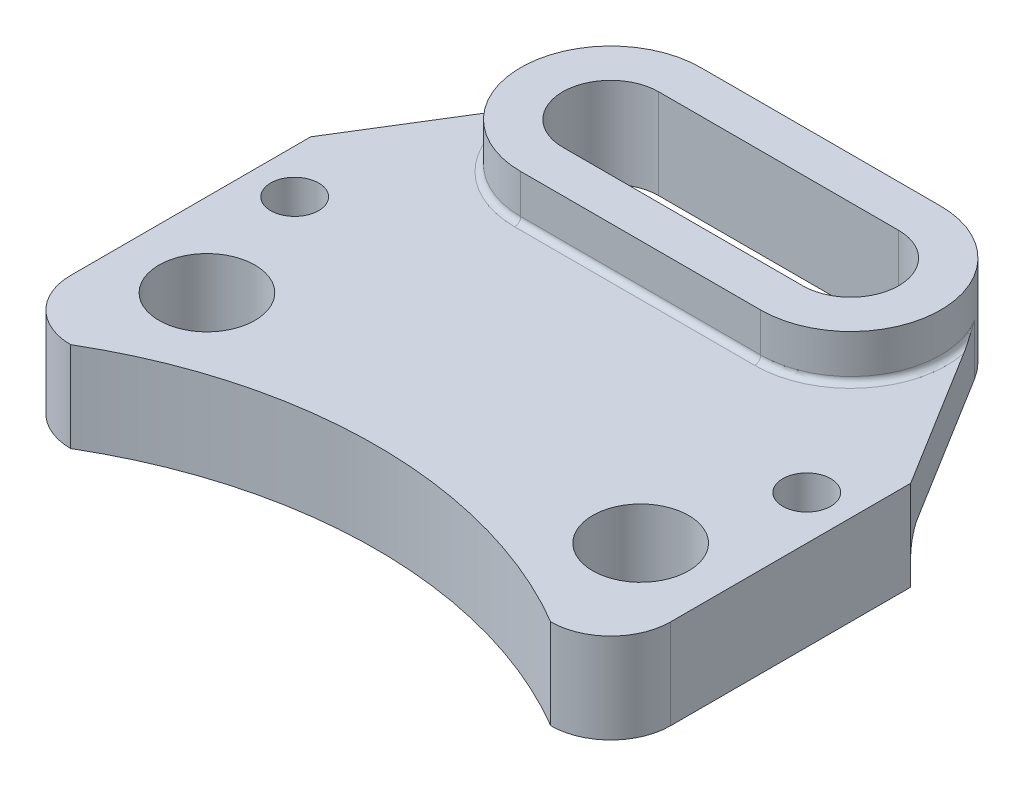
ISO-10303-21;
HEADER;
FILE_DESCRIPTION(('STEP AP214'),'2;1');
FILE_NAME('part.step','',(''),(''),'','','');
FILE_SCHEMA(('AUTOMOTIVE_DESIGN { 1 0 10303 214 1 1 1 1 }'));
ENDSEC;
DATA;
#1=APPLICATION_CONTEXT('core data for automotive mechanical design processes');
#2=APPLICATION_PROTOCOL_DEFINITION('international standard','automotive_design',2000,#1);
#3=PRODUCT_CONTEXT('',#1,'mechanical');
#4=PRODUCT('Part','Part','',(#3));
#5=PRODUCT_RELATED_PRODUCT_CATEGORY('part','',(#4));
#6=PRODUCT_DEFINITION_FORMATION('','',#4);
#7=PRODUCT_DEFINITION_CONTEXT('part definition',#1,'design');
#8=PRODUCT_DEFINITION('design','',#6,#7);
#9=PRODUCT_DEFINITION_SHAPE('','',#8);
#10=(LENGTH_UNIT() NAMED_UNIT(*) SI_UNIT(.MILLI.,.METRE.));
#11=(NAMED_UNIT(*) PLANE_ANGLE_UNIT() SI_UNIT($,.RADIAN.));
#12=(NAMED_UNIT(*) SI_UNIT($,.STERADIAN.) SOLID_ANGLE_UNIT());
#13=UNCERTAINTY_MEASURE_WITH_UNIT(LENGTH_MEASURE(1.E-05),#10,'distance_accuracy_value','');
#14=(GEOMETRIC_REPRESENTATION_CONTEXT(3) GLOBAL_UNCERTAINTY_ASSIGNED_CONTEXT((#13)) GLOBAL_UNIT_ASSIGNED_CONTEXT((#10,
#11,#12)) REPRESENTATION_CONTEXT('',''));
#15=CARTESIAN_POINT('',(0.,0.,0.));
#16=DIRECTION('',(0.,0.,1.));
#17=DIRECTION('',(1.,0.,0.));
#18=AXIS2_PLACEMENT_3D('',#15,#16,#17);
#19=CARTESIAN_POINT('',(0.,16.,-13.9997133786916));
#20=DIRECTION('',(1.,0.,0.));
#21=DIRECTION('',(0.,0.,-1.));
#22=AXIS2_PLACEMENT_3D('',#19,#20,#21);
#23=CYLINDRICAL_SURFACE('',#22,1.);
#24=CARTESIAN_POINT('',(69.9995364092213,16.,-13.9997133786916));
#25=DIRECTION('',(-1.,0.,0.));
#26=DIRECTION('',(0.,0.,1.));
#27=AXIS2_PLACEMENT_3D('',#24,#25,#26);
#28=CIRCLE('',#27,1.);
#29=CARTESIAN_POINT('',(69.9995364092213,16.,-14.9997133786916));
#30=VERTEX_POINT('',#29);
#31=CARTESIAN_POINT('',(69.9995364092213,15.,-13.9997133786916));
#32=VERTEX_POINT('',#31);
#33=EDGE_CURVE('E57',#30,#32,#28,.T.);
#34=ORIENTED_EDGE('',*,*,#33,.F.);
#35=DIRECTION('',(1.,0.,0.));
#36=VECTOR('',#35,1.);
#37=CARTESIAN_POINT('',(0.,16.,-14.9997133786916));
#38=LINE('',#37,#36);
#39=CARTESIAN_POINT('',(29.9995364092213,16.,-14.9997133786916));
#40=VERTEX_POINT('',#39);
#41=EDGE_CURVE('E360',#40,#30,#38,.T.);
#42=ORIENTED_EDGE('',*,*,#41,.F.);
#43=CARTESIAN_POINT('',(29.9995364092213,16.,-13.9997133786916));
#44=DIRECTION('',(-1.,0.,0.));
#45=DIRECTION('',(0.,0.,1.));
#46=AXIS2_PLACEMENT_3D('',#43,#44,#45);
#47=CIRCLE('',#46,1.);
#48=CARTESIAN_POINT('',(29.9995364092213,15.,-13.9997133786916));
#49=VERTEX_POINT('',#48);
#50=EDGE_CURVE('E374',#40,#49,#47,.T.);
#51=ORIENTED_EDGE('',*,*,#50,.T.);
#52=DIRECTION('',(1.,0.,0.));
#53=VECTOR('',#52,1.);
#54=CARTESIAN_POINT('',(90.,15.,-13.9997133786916));
#55=LINE('',#54,#53);
#56=EDGE_CURVE('E354',#32,#49,#55,.F.);
#57=ORIENTED_EDGE('',*,*,#56,.F.);
#58=EDGE_LOOP('',(#34,#42,#51,#57));
#59=FACE_BOUND('',#58,.T.);
#60=ADVANCED_FACE('F45',(#59),#23,.F.);
#61=CARTESIAN_POINT('',(29.9995364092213,16.,-29.9997133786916));
#62=DIRECTION('',(0.,1.,0.));
#63=DIRECTION('',(0.,0.,1.));
#64=AXIS2_PLACEMENT_3D('',#61,#62,#63);
#65=TOROIDAL_SURFACE('',#64,16.,1.);
#66=ORIENTED_EDGE('',*,*,#50,.F.);
#67=CARTESIAN_POINT('',(29.9995364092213,16.,-29.9997133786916));
#68=DIRECTION('',(0.,1.,0.));
#69=DIRECTION('',(0.,0.,1.));
#70=AXIS2_PLACEMENT_3D('',#67,#68,#69);
#71=CIRCLE('',#70,15.);
#72=CARTESIAN_POINT('',(17.2408948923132,16.,-37.8874929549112));
#73=VERTEX_POINT('',#72);
#74=EDGE_CURVE('E348',#73,#40,#71,.T.);
#75=ORIENTED_EDGE('',*,*,#74,.F.);
#76=CARTESIAN_POINT('',(14.3130750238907,15.,-33.1516856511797));
#77=CARTESIAN_POINT('',(14.3572474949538,15.0000065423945,-33.2231355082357));
#78=CARTESIAN_POINT('',(14.4014147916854,15.0012809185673,-33.2945769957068));
#79=CARTESIAN_POINT('',(14.4897080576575,15.0061151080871,-33.437393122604));
#80=CARTESIAN_POINT('',(14.5338340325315,15.0096745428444,-33.5087677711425));
#81=CARTESIAN_POINT('',(14.6660517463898,15.0233982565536,-33.7226325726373));
#82=CARTESIAN_POINT('',(14.754057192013,15.0366087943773,-33.8649831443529));
#83=CARTESIAN_POINT('',(14.9293958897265,15.0695611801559,-34.1485970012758));
#84=CARTESIAN_POINT('',(15.0167304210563,15.089279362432,-34.2898623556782));
#85=CARTESIAN_POINT('',(15.1910337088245,15.1340925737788,-34.5718014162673));
#86=CARTESIAN_POINT('',(15.2780023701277,15.1591889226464,-34.7124749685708));
#87=CARTESIAN_POINT('',(15.5218635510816,15.2358867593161,-35.1069253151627));
#88=CARTESIAN_POINT('',(15.6783187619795,15.2924886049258,-35.3599947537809));
#89=CARTESIAN_POINT('',(15.990140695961,15.4155229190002,-35.8643729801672));
#90=CARTESIAN_POINT('',(16.1455073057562,15.4819563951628,-36.1156815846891));
#91=CARTESIAN_POINT('',(16.6108551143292,15.6906909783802,-36.8683909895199));
#92=CARTESIAN_POINT('',(16.9196629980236,15.842272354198,-37.3678939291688));
#93=CARTESIAN_POINT('',(17.2325804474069,15.9959175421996,-37.8740441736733));
#94=CARTESIAN_POINT('',(17.2367376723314,15.997958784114,-37.8807685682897));
#95=CARTESIAN_POINT('',(17.2408948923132,16.,-37.8874929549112));
#96=B_SPLINE_CURVE_WITH_KNOTS('',3,(#76,#77,#78,#79,#80,#81,#82,#83,#84,#85,#86,#87,#88,#89,#90,
#91,#92,#93,#94,#95),.UNSPECIFIED.,.F.,.F.,(4,2,2,2,2,2,2,2,2,4),(0.,0.251980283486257,
0.503918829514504,1.00737471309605,1.50901954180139,2.01078761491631,2.91909735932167,
3.82750026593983,5.64675090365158,5.67124580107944),.UNSPECIFIED.);
#97=CARTESIAN_POINT('',(14.3130750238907,15.,-33.1516856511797));
#98=VERTEX_POINT('',#97);
#99=EDGE_CURVE('E366',#73,#98,#96,.F.);
#100=ORIENTED_EDGE('',*,*,#99,.T.);
#101=CARTESIAN_POINT('',(29.9995364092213,15.,-29.9997133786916));
#102=DIRECTION('',(0.,1.,0.));
#103=DIRECTION('',(0.,0.,1.));
#104=AXIS2_PLACEMENT_3D('',#101,#102,#103);
#105=CIRCLE('',#104,16.);
#106=EDGE_CURVE('E357',#49,#98,#105,.F.);
#107=ORIENTED_EDGE('',*,*,#106,.F.);
#108=EDGE_LOOP('',(#66,#75,#100,#107));
#109=FACE_BOUND('',#108,.T.);
#110=ADVANCED_FACE('F378',(#109),#65,.F.);
#111=CARTESIAN_POINT('',(69.9995364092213,16.,-29.9997133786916));
#112=DIRECTION('',(0.,1.,0.));
#113=DIRECTION('',(0.,0.,1.));
#114=AXIS2_PLACEMENT_3D('',#111,#112,#113);
#115=TOROIDAL_SURFACE('',#114,16.,1.);
#116=CARTESIAN_POINT('',(69.9995364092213,16.,-29.9997133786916));
#117=DIRECTION('',(0.,1.,0.));
#118=DIRECTION('',(0.,0.,1.));
#119=AXIS2_PLACEMENT_3D('',#116,#117,#118);
#120=CIRCLE('',#119,15.);
#121=CARTESIAN_POINT('',(82.7579881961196,16.,-37.8877998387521));
#122=VERTEX_POINT('',#121);
#123=EDGE_CURVE('E363',#30,#122,#120,.T.);
#124=ORIENTED_EDGE('',*,*,#123,.F.);
#125=ORIENTED_EDGE('',*,*,#33,.T.);
#126=CARTESIAN_POINT('',(69.9995364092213,15.,-29.9997133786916));
#127=DIRECTION('',(0.,1.,0.));
#128=DIRECTION('',(0.,0.,1.));
#129=AXIS2_PLACEMENT_3D('',#126,#127,#128);
#130=CIRCLE('',#129,16.);
#131=CARTESIAN_POINT('',(85.6859219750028,15.,-33.1520629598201));
#132=VERTEX_POINT('',#131);
#133=EDGE_CURVE('E351',#132,#32,#130,.F.);
#134=ORIENTED_EDGE('',*,*,#133,.F.);
#135=CARTESIAN_POINT('',(85.6859219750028,15.,-33.1520629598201));
#136=CARTESIAN_POINT('',(85.6417477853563,15.0000065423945,-33.223511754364));
#137=CARTESIAN_POINT('',(85.5975787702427,15.0012809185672,-33.2949521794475));
#138=CARTESIAN_POINT('',(85.5092820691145,15.0061151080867,-33.4377661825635));
#139=CARTESIAN_POINT('',(85.4651543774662,15.0096745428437,-33.5091397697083));
#140=CARTESIAN_POINT('',(85.3329315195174,15.0233982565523,-33.7230013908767));
#141=CARTESIAN_POINT('',(85.2449226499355,15.0366087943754,-33.8653498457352));
#142=CARTESIAN_POINT('',(85.069577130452,15.0695611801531,-34.1489594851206));
#143=CARTESIAN_POINT('',(84.9822392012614,15.0892793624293,-34.2902227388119));
#144=CARTESIAN_POINT('',(84.8079291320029,15.1340925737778,-34.5721576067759));
#145=CARTESIAN_POINT('',(84.7209570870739,15.1591889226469,-34.7128290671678));
#146=CARTESIAN_POINT('',(84.4770864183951,15.235886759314,-35.1072735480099));
#147=CARTESIAN_POINT('',(84.3206251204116,15.2924886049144,-35.3603392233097));
#148=CARTESIAN_POINT('',(84.0087910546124,15.415522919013,-35.8647099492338));
#149=CARTESIAN_POINT('',(83.8534184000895,15.481956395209,-36.1160148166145));
#150=CARTESIAN_POINT('',(83.388052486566,15.6906909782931,-36.8687130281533));
#151=CARTESIAN_POINT('',(83.079232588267,15.8422723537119,-37.3682085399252));
#152=CARTESIAN_POINT('',(82.7663029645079,15.9959175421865,-37.87435125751));
#153=CARTESIAN_POINT('',(82.7621455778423,15.9979587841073,-37.8810755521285));
#154=CARTESIAN_POINT('',(82.7579881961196,16.,-37.8877998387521));
#155=B_SPLINE_CURVE_WITH_KNOTS('',3,(#135,#136,#137,#138,#139,#140,#141,#142,#143,#144,#145,
#146,#147,#148,#149,#150,#151,#152,#153,#154),.UNSPECIFIED.,.F.,.F.,(4,2,2,2,2,2,2,2,2,4),(0.,
0.251980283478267,0.503918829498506,1.00737471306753,1.50901954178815,2.01078761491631,
2.91909735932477,3.82750026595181,5.64675090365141,5.67124580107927),.UNSPECIFIED.);
#156=EDGE_CURVE('E11',#132,#122,#155,.T.);
#157=ORIENTED_EDGE('',*,*,#156,.T.);
#158=EDGE_LOOP('',(#124,#125,#134,#157));
#159=FACE_BOUND('',#158,.T.);
#160=ADVANCED_FACE('F382',(#159),#115,.F.);
#161=CARTESIAN_POINT('',(0.,4.5,-13.));
#162=DIRECTION('',(1.,0.,0.));
#163=DIRECTION('',(0.,0.,-1.));
#164=AXIS2_PLACEMENT_3D('',#161,#162,#163);
#165=CYLINDRICAL_SURFACE('',#164,3.);
#166=DIRECTION('',(-1.,0.,0.));
#167=VECTOR('',#166,1.);
#168=CARTESIAN_POINT('',(0.,7.5,-13.));
#169=LINE('',#168,#167);
#170=CARTESIAN_POINT('',(98.1452091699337,7.5,-13.));
#171=VERTEX_POINT('',#170);
#172=CARTESIAN_POINT('',(1.85469108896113,7.5,-13.));
#173=VERTEX_POINT('',#172);
#174=EDGE_CURVE('E337',#171,#173,#169,.T.);
#175=ORIENTED_EDGE('',*,*,#174,.F.);
#176=CARTESIAN_POINT('',(98.1452091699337,4.5,-13.));
#177=DIRECTION('',(0.850563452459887,0.,-0.525872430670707));
#178=DIRECTION('',(0.525872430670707,0.,0.850563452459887));
#179=AXIS2_PLACEMENT_3D('',#176,#177,#178);
#180=ELLIPSE('',#179,3.52707371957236,3.);
#181=CARTESIAN_POINT('',(100.,4.5,-10.));
#182=VERTEX_POINT('',#181);
#183=EDGE_CURVE('E343',#171,#182,#180,.T.);
#184=ORIENTED_EDGE('',*,*,#183,.T.);
#185=DIRECTION('',(-1.,0.,0.));
#186=VECTOR('',#185,1.);
#187=CARTESIAN_POINT('',(0.,4.5,-10.));
#188=LINE('',#187,#186);
#189=CARTESIAN_POINT('',(0.,4.5,-10.));
#190=VERTEX_POINT('',#189);
#191=EDGE_CURVE('E340',#190,#182,#188,.F.);
#192=ORIENTED_EDGE('',*,*,#191,.F.);
#193=CARTESIAN_POINT('',(1.85469108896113,4.5,-13.));
#194=DIRECTION('',(0.850576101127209,0.,0.525851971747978));
#195=DIRECTION('',(0.525851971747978,0.,-0.850576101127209));
#196=AXIS2_PLACEMENT_3D('',#193,#194,#195);
#197=ELLIPSE('',#196,3.52702126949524,3.);
#198=EDGE_CURVE('E346',#190,#173,#197,.F.);
#199=ORIENTED_EDGE('',*,*,#198,.T.);
#200=EDGE_LOOP('',(#175,#184,#192,#199));
#201=FACE_BOUND('',#200,.T.);
#202=ADVANCED_FACE('F384',(#201),#165,.F.);
#203=CARTESIAN_POINT('',(0.,15.,-10.));
#204=DIRECTION('',(0.,0.,1.));
#205=DIRECTION('',(1.,0.,0.));
#206=AXIS2_PLACEMENT_3D('',#203,#204,#205);
#207=PLANE('',#206);
#208=DIRECTION('',(0.,-1.,0.));
#209=VECTOR('',#208,1.);
#210=CARTESIAN_POINT('',(0.,15.,-10.));
#211=LINE('',#210,#209);
#212=CARTESIAN_POINT('',(0.,0.,-10.));
#213=VERTEX_POINT('',#212);
#214=EDGE_CURVE('E306',#190,#213,#211,.T.);
#215=ORIENTED_EDGE('',*,*,#214,.F.);
#216=ORIENTED_EDGE('',*,*,#191,.T.);
#217=DIRECTION('',(0.,-1.,0.));
#218=VECTOR('',#217,1.);
#219=CARTESIAN_POINT('',(100.,15.,-10.));
#220=LINE('',#219,#218);
#221=CARTESIAN_POINT('',(100.,0.,-10.));
#222=VERTEX_POINT('',#221);
#223=EDGE_CURVE('E322',#182,#222,#220,.T.);
#224=ORIENTED_EDGE('',*,*,#223,.T.);
#225=DIRECTION('',(-1.,0.,0.));
#226=VECTOR('',#225,1.);
#227=CARTESIAN_POINT('',(0.,0.,-10.));
#228=LINE('',#227,#226);
#229=EDGE_CURVE('E298',#222,#213,#228,.T.);
#230=ORIENTED_EDGE('',*,*,#229,.T.);
#231=EDGE_LOOP('',(#215,#216,#224,#230));
#232=FACE_BOUND('',#231,.T.);
#233=ADVANCED_FACE('F393',(#232),#207,.F.);
#234=CARTESIAN_POINT('',(0.,15.,0.));
#235=DIRECTION('',(1.,0.,0.));
#236=DIRECTION('',(0.,0.,-1.));
#237=AXIS2_PLACEMENT_3D('',#234,#235,#236);
#238=PLANE('',#237);
#239=DIRECTION('',(0.,0.,1.));
#240=VECTOR('',#239,1.);
#241=CARTESIAN_POINT('',(0.,0.,0.));
#242=LINE('',#241,#240);
#243=CARTESIAN_POINT('',(0.,0.,29.9999999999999));
#244=VERTEX_POINT('',#243);
#245=EDGE_CURVE('E292',#213,#244,#242,.T.);
#246=ORIENTED_EDGE('',*,*,#245,.T.);
#247=DIRECTION('',(0.,-1.,0.));
#248=VECTOR('',#247,1.);
#249=CARTESIAN_POINT('',(0.,15.,29.9999999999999));
#250=LINE('',#249,#248);
#251=CARTESIAN_POINT('',(0.,15.,29.9999999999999));
#252=VERTEX_POINT('',#251);
#253=EDGE_CURVE('E334',#252,#244,#250,.T.);
#254=ORIENTED_EDGE('',*,*,#253,.F.);
#255=DIRECTION('',(0.,0.,1.));
#256=VECTOR('',#255,1.);
#257=CARTESIAN_POINT('',(0.,15.,0.));
#258=LINE('',#257,#256);
#259=CARTESIAN_POINT('',(0.,15.,-10.));
#260=VERTEX_POINT('',#259);
#261=EDGE_CURVE('E295',#260,#252,#258,.T.);
#262=ORIENTED_EDGE('',*,*,#261,.F.);
#263=EDGE_CURVE('E320',#260,#190,#211,.T.);
#264=ORIENTED_EDGE('',*,*,#263,.T.);
#265=ORIENTED_EDGE('',*,*,#214,.T.);
#266=EDGE_LOOP('',(#246,#254,#262,#264,#265));
#267=FACE_BOUND('',#266,.T.);
#268=ADVANCED_FACE('F526',(#267),#238,.F.);
#269=CARTESIAN_POINT('',(10.,15.,30.));
#270=DIRECTION('',(0.,-1.,0.));
#271=DIRECTION('',(0.,0.,-1.));
#272=AXIS2_PLACEMENT_3D('',#269,#270,#271);
#273=CYLINDRICAL_SURFACE('',#272,10.);
#274=CARTESIAN_POINT('',(10.,0.,30.));
#275=DIRECTION('',(0.,1.,0.));
#276=DIRECTION('',(0.,0.,1.));
#277=AXIS2_PLACEMENT_3D('',#274,#275,#276);
#278=CIRCLE('',#277,10.);
#279=CARTESIAN_POINT('',(10.,0.,40.));
#280=VERTEX_POINT('',#279);
#281=EDGE_CURVE('E308',#244,#280,#278,.T.);
#282=ORIENTED_EDGE('',*,*,#281,.T.);
#283=DIRECTION('',(0.,-1.,0.));
#284=VECTOR('',#283,1.);
#285=CARTESIAN_POINT('',(10.,15.,40.));
#286=LINE('',#285,#284);
#287=CARTESIAN_POINT('',(10.,15.,40.));
#288=VERTEX_POINT('',#287);
#289=EDGE_CURVE('E331',#288,#280,#286,.T.);
#290=ORIENTED_EDGE('',*,*,#289,.F.);
#291=CARTESIAN_POINT('',(10.,15.,30.));
#292=DIRECTION('',(0.,1.,0.));
#293=DIRECTION('',(0.,0.,1.));
#294=AXIS2_PLACEMENT_3D('',#291,#292,#293);
#295=CIRCLE('',#294,10.);
#296=EDGE_CURVE('E297',#252,#288,#295,.T.);
#297=ORIENTED_EDGE('',*,*,#296,.F.);
#298=ORIENTED_EDGE('',*,*,#253,.T.);
#299=EDGE_LOOP('',(#282,#290,#297,#298));
#300=FACE_BOUND('',#299,.T.);
#301=ADVANCED_FACE('F607',(#300),#273,.T.);
#302=CARTESIAN_POINT('',(50.,15.,107.754881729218));
#303=DIRECTION('',(0.,-1.,0.));
#304=DIRECTION('',(0.,0.,-1.));
#305=AXIS2_PLACEMENT_3D('',#302,#303,#304);
#306=CYLINDRICAL_SURFACE('',#305,78.6811540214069);
#307=CARTESIAN_POINT('',(50.,0.,107.754881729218));
#308=DIRECTION('',(0.,-1.,0.));
#309=DIRECTION('',(0.,0.,-1.));
#310=AXIS2_PLACEMENT_3D('',#307,#308,#309);
#311=CIRCLE('',#310,78.6811540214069);
#312=CARTESIAN_POINT('',(90.,0.,40.));
#313=VERTEX_POINT('',#312);
#314=EDGE_CURVE('E310',#280,#313,#311,.T.);
#315=ORIENTED_EDGE('',*,*,#314,.T.);
#316=DIRECTION('',(0.,-1.,0.));
#317=VECTOR('',#316,1.);
#318=CARTESIAN_POINT('',(90.,15.,40.));
#319=LINE('',#318,#317);
#320=CARTESIAN_POINT('',(90.,15.,40.));
#321=VERTEX_POINT('',#320);
#322=EDGE_CURVE('E328',#321,#313,#319,.T.);
#323=ORIENTED_EDGE('',*,*,#322,.F.);
#324=CARTESIAN_POINT('',(50.,15.,107.754881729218));
#325=DIRECTION('',(0.,-1.,0.));
#326=DIRECTION('',(0.,0.,-1.));
#327=AXIS2_PLACEMENT_3D('',#324,#325,#326);
#328=CIRCLE('',#327,78.6811540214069);
#329=EDGE_CURVE('E300',#288,#321,#328,.T.);
#330=ORIENTED_EDGE('',*,*,#329,.F.);
#331=ORIENTED_EDGE('',*,*,#289,.T.);
#332=EDGE_LOOP('',(#315,#323,#330,#331));
#333=FACE_BOUND('',#332,.T.);
#334=ADVANCED_FACE('F598',(#333),#306,.F.);
#335=CARTESIAN_POINT('',(90.,15.,30.));
#336=DIRECTION('',(0.,-1.,0.));
#337=DIRECTION('',(0.,0.,-1.));
#338=AXIS2_PLACEMENT_3D('',#335,#336,#337);
#339=CYLINDRICAL_SURFACE('',#338,10.);
#340=CARTESIAN_POINT('',(90.,0.,30.));
#341=DIRECTION('',(0.,1.,0.));
#342=DIRECTION('',(0.,0.,1.));
#343=AXIS2_PLACEMENT_3D('',#340,#341,#342);
#344=CIRCLE('',#343,10.);
#345=CARTESIAN_POINT('',(100.,0.,29.9999999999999));
#346=VERTEX_POINT('',#345);
#347=EDGE_CURVE('E312',#313,#346,#344,.T.);
#348=ORIENTED_EDGE('',*,*,#347,.T.);
#349=DIRECTION('',(0.,-1.,0.));
#350=VECTOR('',#349,1.);
#351=CARTESIAN_POINT('',(100.,15.,29.9999999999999));
#352=LINE('',#351,#350);
#353=CARTESIAN_POINT('',(100.,15.,29.9999999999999));
#354=VERTEX_POINT('',#353);
#355=EDGE_CURVE('E325',#354,#346,#352,.T.);
#356=ORIENTED_EDGE('',*,*,#355,.F.);
#357=CARTESIAN_POINT('',(90.,15.,30.));
#358=DIRECTION('',(0.,1.,0.));
#359=DIRECTION('',(0.,0.,1.));
#360=AXIS2_PLACEMENT_3D('',#357,#358,#359);
#361=CIRCLE('',#360,10.);
#362=EDGE_CURVE('E302',#321,#354,#361,.T.);
#363=ORIENTED_EDGE('',*,*,#362,.F.);
#364=ORIENTED_EDGE('',*,*,#322,.T.);
#365=EDGE_LOOP('',(#348,#356,#363,#364));
#366=FACE_BOUND('',#365,.T.);
#367=ADVANCED_FACE('F589',(#366),#339,.T.);
#368=CARTESIAN_POINT('',(100.,15.,-10.));
#369=DIRECTION('',(-1.,0.,0.));
#370=DIRECTION('',(0.,0.,1.));
#371=AXIS2_PLACEMENT_3D('',#368,#369,#370);
#372=PLANE('',#371);
#373=DIRECTION('',(0.,0.,-1.));
#374=VECTOR('',#373,1.);
#375=CARTESIAN_POINT('',(100.,0.,-10.));
#376=LINE('',#375,#374);
#377=EDGE_CURVE('E315',#346,#222,#376,.T.);
#378=ORIENTED_EDGE('',*,*,#377,.T.);
#379=ORIENTED_EDGE('',*,*,#223,.F.);
#380=CARTESIAN_POINT('',(100.,15.,-10.));
#381=VERTEX_POINT('',#380);
#382=EDGE_CURVE('E323',#381,#182,#220,.T.);
#383=ORIENTED_EDGE('',*,*,#382,.F.);
#384=DIRECTION('',(0.,0.,-1.));
#385=VECTOR('',#384,1.);
#386=CARTESIAN_POINT('',(100.,15.,29.9999999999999));
#387=LINE('',#386,#385);
#388=EDGE_CURVE('E304',#354,#381,#387,.T.);
#389=ORIENTED_EDGE('',*,*,#388,.F.);
#390=ORIENTED_EDGE('',*,*,#355,.T.);
#391=EDGE_LOOP('',(#378,#379,#383,#389,#390));
#392=FACE_BOUND('',#391,.T.);
#393=ADVANCED_FACE('F580',(#392),#372,.F.);
#394=CARTESIAN_POINT('',(90.,15.,30.));
#395=DIRECTION('',(0.,1.,0.));
#396=DIRECTION('',(0.,0.,1.));
#397=AXIS2_PLACEMENT_3D('',#394,#395,#396);
#398=PLANE('',#397);
#399=CARTESIAN_POINT('',(86.1412236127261,15.,21.1505395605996));
#400=DIRECTION('',(0.,-1.,0.));
#401=DIRECTION('',(0.,0.,1.));
#402=AXIS2_PLACEMENT_3D('',#399,#400,#401);
#403=CIRCLE('',#402,8.);
#404=CARTESIAN_POINT('',(86.1412236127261,15.,29.1505395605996));
#405=VERTEX_POINT('',#404);
#406=EDGE_CURVE('E269',#405,#405,#403,.T.);
#407=ORIENTED_EDGE('',*,*,#406,.T.);
#408=EDGE_LOOP('',(#407));
#409=FACE_BOUND('',#408,.T.);
#410=CARTESIAN_POINT('',(92.672770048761,15.,0.));
#411=DIRECTION('',(0.,-1.,0.));
#412=DIRECTION('',(0.,0.,1.));
#413=AXIS2_PLACEMENT_3D('',#410,#411,#412);
#414=CIRCLE('',#413,3.99999999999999);
#415=CARTESIAN_POINT('',(92.672770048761,15.,4.00000000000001));
#416=VERTEX_POINT('',#415);
#417=EDGE_CURVE('E281',#416,#416,#414,.T.);
#418=ORIENTED_EDGE('',*,*,#417,.T.);
#419=EDGE_LOOP('',(#418));
#420=FACE_BOUND('',#419,.T.);
#421=CARTESIAN_POINT('',(7.32722995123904,15.,0.));
#422=DIRECTION('',(0.,-1.,0.));
#423=DIRECTION('',(0.,0.,-1.));
#424=AXIS2_PLACEMENT_3D('',#421,#422,#423);
#425=CIRCLE('',#424,4.);
#426=CARTESIAN_POINT('',(7.32722995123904,15.,-4.));
#427=VERTEX_POINT('',#426);
#428=EDGE_CURVE('E275',#427,#427,#425,.T.);
#429=ORIENTED_EDGE('',*,*,#428,.T.);
#430=EDGE_LOOP('',(#429));
#431=FACE_BOUND('',#430,.T.);
#432=CARTESIAN_POINT('',(13.8587763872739,15.,21.1505395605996));
#433=DIRECTION('',(0.,-1.,0.));
#434=DIRECTION('',(0.,0.,-1.));
#435=AXIS2_PLACEMENT_3D('',#432,#433,#434);
#436=CIRCLE('',#435,8.);
#437=CARTESIAN_POINT('',(13.8587763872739,15.,13.1505395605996));
#438=VERTEX_POINT('',#437);
#439=EDGE_CURVE('E289',#438,#438,#436,.T.);
#440=ORIENTED_EDGE('',*,*,#439,.T.);
#441=EDGE_LOOP('',(#440));
#442=FACE_BOUND('',#441,.T.);
#443=ORIENTED_EDGE('',*,*,#56,.T.);
#444=ORIENTED_EDGE('',*,*,#106,.T.);
#445=DIRECTION('',(0.525851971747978,0.,-0.850576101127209));
#446=VECTOR('',#445,1.);
#447=CARTESIAN_POINT('',(-4.4727711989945,15.,-2.76520296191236));
#448=LINE('',#447,#446);
#449=EDGE_CURVE('E257',#260,#98,#448,.T.);
#450=ORIENTED_EDGE('',*,*,#449,.F.);
#451=ORIENTED_EDGE('',*,*,#261,.T.);
#452=ORIENTED_EDGE('',*,*,#296,.T.);
#453=ORIENTED_EDGE('',*,*,#329,.T.);
#454=ORIENTED_EDGE('',*,*,#362,.T.);
#455=ORIENTED_EDGE('',*,*,#388,.T.);
#456=DIRECTION('',(-0.525872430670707,0.,-0.850563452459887));
#457=VECTOR('',#456,1.);
#458=CARTESIAN_POINT('',(76.8186973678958,15.,-47.4942051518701));
#459=LINE('',#458,#457);
#460=EDGE_CURVE('E261',#381,#132,#459,.T.);
#461=ORIENTED_EDGE('',*,*,#460,.T.);
#462=ORIENTED_EDGE('',*,*,#133,.T.);
#463=EDGE_LOOP('',(#443,#444,#450,#451,#452,#453,#454,#455,#461,#462));
#464=FACE_BOUND('',#463,.T.);
#465=ADVANCED_FACE('F572',(#409,#420,#431,#442,#464),#398,.T.);
#466=CARTESIAN_POINT('',(90.,0.,30.));
#467=DIRECTION('',(0.,1.,0.));
#468=DIRECTION('',(0.,0.,1.));
#469=AXIS2_PLACEMENT_3D('',#466,#467,#468);
#470=PLANE('',#469);
#471=CARTESIAN_POINT('',(86.1412236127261,0.,21.1505395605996));
#472=DIRECTION('',(0.,-1.,0.));
#473=DIRECTION('',(0.,0.,1.));
#474=AXIS2_PLACEMENT_3D('',#471,#472,#473);
#475=CIRCLE('',#474,8.);
#476=CARTESIAN_POINT('',(86.1412236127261,0.,29.1505395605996));
#477=VERTEX_POINT('',#476);
#478=EDGE_CURVE('E284',#477,#477,#475,.T.);
#479=ORIENTED_EDGE('',*,*,#478,.F.);
#480=EDGE_LOOP('',(#479));
#481=FACE_BOUND('',#480,.T.);
#482=CARTESIAN_POINT('',(92.672770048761,0.,0.));
#483=DIRECTION('',(0.,-1.,0.));
#484=DIRECTION('',(0.,0.,1.));
#485=AXIS2_PLACEMENT_3D('',#482,#483,#484);
#486=CIRCLE('',#485,3.99999999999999);
#487=CARTESIAN_POINT('',(92.672770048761,0.,4.00000000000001));
#488=VERTEX_POINT('',#487);
#489=EDGE_CURVE('E278',#488,#488,#486,.T.);
#490=ORIENTED_EDGE('',*,*,#489,.F.);
#491=EDGE_LOOP('',(#490));
#492=FACE_BOUND('',#491,.T.);
#493=CARTESIAN_POINT('',(7.32722995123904,0.,0.));
#494=DIRECTION('',(0.,-1.,0.));
#495=DIRECTION('',(0.,0.,-1.));
#496=AXIS2_PLACEMENT_3D('',#493,#494,#495);
#497=CIRCLE('',#496,4.);
#498=CARTESIAN_POINT('',(7.32722995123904,0.,-4.));
#499=VERTEX_POINT('',#498);
#500=EDGE_CURVE('E271',#499,#499,#497,.T.);
#501=ORIENTED_EDGE('',*,*,#500,.F.);
#502=EDGE_LOOP('',(#501));
#503=FACE_BOUND('',#502,.T.);
#504=CARTESIAN_POINT('',(13.8587763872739,0.,21.1505395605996));
#505=DIRECTION('',(0.,-1.,0.));
#506=DIRECTION('',(0.,0.,-1.));
#507=AXIS2_PLACEMENT_3D('',#504,#505,#506);
#508=CIRCLE('',#507,8.);
#509=CARTESIAN_POINT('',(13.8587763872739,0.,13.1505395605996));
#510=VERTEX_POINT('',#509);
#511=EDGE_CURVE('E274',#510,#510,#508,.T.);
#512=ORIENTED_EDGE('',*,*,#511,.F.);
#513=EDGE_LOOP('',(#512));
#514=FACE_BOUND('',#513,.T.);
#515=ORIENTED_EDGE('',*,*,#245,.F.);
#516=ORIENTED_EDGE('',*,*,#229,.F.);
#517=ORIENTED_EDGE('',*,*,#377,.F.);
#518=ORIENTED_EDGE('',*,*,#347,.F.);
#519=ORIENTED_EDGE('',*,*,#314,.F.);
#520=ORIENTED_EDGE('',*,*,#281,.F.);
#521=EDGE_LOOP('',(#515,#516,#517,#518,#519,#520));
#522=FACE_BOUND('',#521,.T.);
#523=ADVANCED_FACE('F563',(#481,#492,#503,#514,#522),#470,.F.);
#524=CARTESIAN_POINT('',(13.8587763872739,15.,21.1505395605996));
#525=DIRECTION('',(0.,-1.,0.));
#526=DIRECTION('',(0.,0.,-1.));
#527=AXIS2_PLACEMENT_3D('',#524,#525,#526);
#528=CYLINDRICAL_SURFACE('',#527,8.);
#529=ORIENTED_EDGE('',*,*,#439,.F.);
#530=EDGE_LOOP('',(#529));
#531=FACE_BOUND('',#530,.T.);
#532=ORIENTED_EDGE('',*,*,#511,.T.);
#533=EDGE_LOOP('',(#532));
#534=FACE_BOUND('',#533,.T.);
#535=ADVANCED_FACE('F555',(#531,#534),#528,.F.);
#536=CARTESIAN_POINT('',(7.32722995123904,15.,0.));
#537=DIRECTION('',(0.,-1.,0.));
#538=DIRECTION('',(0.,0.,-1.));
#539=AXIS2_PLACEMENT_3D('',#536,#537,#538);
#540=CYLINDRICAL_SURFACE('',#539,4.);
#541=ORIENTED_EDGE('',*,*,#428,.F.);
#542=EDGE_LOOP('',(#541));
#543=FACE_BOUND('',#542,.T.);
#544=ORIENTED_EDGE('',*,*,#500,.T.);
#545=EDGE_LOOP('',(#544));
#546=FACE_BOUND('',#545,.T.);
#547=ADVANCED_FACE('F546',(#543,#546),#540,.F.);
#548=CARTESIAN_POINT('',(92.672770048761,15.,0.));
#549=DIRECTION('',(0.,-1.,0.));
#550=DIRECTION('',(0.,0.,-1.));
#551=AXIS2_PLACEMENT_3D('',#548,#549,#550);
#552=CYLINDRICAL_SURFACE('',#551,3.99999999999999);
#553=ORIENTED_EDGE('',*,*,#417,.F.);
#554=EDGE_LOOP('',(#553));
#555=FACE_BOUND('',#554,.T.);
#556=ORIENTED_EDGE('',*,*,#489,.T.);
#557=EDGE_LOOP('',(#556));
#558=FACE_BOUND('',#557,.T.);
#559=ADVANCED_FACE('F537',(#555,#558),#552,.F.);
#560=CARTESIAN_POINT('',(86.1412236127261,15.,21.1505395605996));
#561=DIRECTION('',(0.,-1.,0.));
#562=DIRECTION('',(0.,0.,-1.));
#563=AXIS2_PLACEMENT_3D('',#560,#561,#562);
#564=CYLINDRICAL_SURFACE('',#563,8.);
#565=ORIENTED_EDGE('',*,*,#406,.F.);
#566=EDGE_LOOP('',(#565));
#567=FACE_BOUND('',#566,.T.);
#568=ORIENTED_EDGE('',*,*,#478,.T.);
#569=EDGE_LOOP('',(#568));
#570=FACE_BOUND('',#569,.T.);
#571=ADVANCED_FACE('F518',(#567,#570),#564,.F.);
#572=CARTESIAN_POINT('',(76.8186973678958,7.5,-47.4942051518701));
#573=DIRECTION('',(0.850563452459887,0.,-0.525872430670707));
#574=DIRECTION('',(-0.525872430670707,0.,-0.850563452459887));
#575=AXIS2_PLACEMENT_3D('',#572,#573,#574);
#576=PLANE('',#575);
#577=ORIENTED_EDGE('',*,*,#460,.F.);
#578=ORIENTED_EDGE('',*,*,#382,.T.);
#579=ORIENTED_EDGE('',*,*,#183,.F.);
#580=DIRECTION('',(-0.525872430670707,0.,-0.850563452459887));
#581=VECTOR('',#580,1.);
#582=CARTESIAN_POINT('',(76.8186973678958,7.5,-47.4942051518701));
#583=LINE('',#582,#581);
#584=CARTESIAN_POINT('',(82.7579881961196,7.5,-37.887799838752));
#585=VERTEX_POINT('',#584);
#586=EDGE_CURVE('E260',#171,#585,#583,.T.);
#587=ORIENTED_EDGE('',*,*,#586,.T.);
#588=DIRECTION('',(0.,1.,0.));
#589=VECTOR('',#588,1.);
#590=CARTESIAN_POINT('',(82.7579881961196,7.5,-37.887799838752));
#591=LINE('',#590,#589);
#592=EDGE_CURVE('E64',#585,#122,#591,.T.);
#593=ORIENTED_EDGE('',*,*,#592,.T.);
#594=ORIENTED_EDGE('',*,*,#156,.F.);
#595=EDGE_LOOP('',(#577,#578,#579,#587,#593,#594));
#596=FACE_BOUND('',#595,.T.);
#597=ADVANCED_FACE('F510',(#596),#576,.T.);
#598=CARTESIAN_POINT('',(-4.4727711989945,7.5,-2.76520296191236));
#599=DIRECTION('',(0.850576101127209,0.,0.525851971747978));
#600=DIRECTION('',(0.525851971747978,0.,-0.850576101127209));
#601=AXIS2_PLACEMENT_3D('',#598,#599,#600);
#602=PLANE('',#601);
#603=ORIENTED_EDGE('',*,*,#449,.T.);
#604=ORIENTED_EDGE('',*,*,#99,.F.);
#605=DIRECTION('',(0.,1.,0.));
#606=VECTOR('',#605,1.);
#607=CARTESIAN_POINT('',(17.2408948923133,7.5,-37.8874929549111));
#608=LINE('',#607,#606);
#609=CARTESIAN_POINT('',(17.2408948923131,7.5,-37.8874929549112));
#610=VERTEX_POINT('',#609);
#611=EDGE_CURVE('E263',#610,#73,#608,.T.);
#612=ORIENTED_EDGE('',*,*,#611,.F.);
#613=DIRECTION('',(0.525851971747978,0.,-0.850576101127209));
#614=VECTOR('',#613,1.);
#615=CARTESIAN_POINT('',(-4.4727711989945,7.5,-2.76520296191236));
#616=LINE('',#615,#614);
#617=EDGE_CURVE('E258',#173,#610,#616,.T.);
#618=ORIENTED_EDGE('',*,*,#617,.F.);
#619=ORIENTED_EDGE('',*,*,#198,.F.);
#620=ORIENTED_EDGE('',*,*,#263,.F.);
#621=EDGE_LOOP('',(#603,#604,#612,#618,#619,#620));
#622=FACE_BOUND('',#621,.T.);
#623=ADVANCED_FACE('F375',(#622),#602,.F.);
#624=CARTESIAN_POINT('',(0.,7.5,0.));
#625=DIRECTION('',(0.,1.,0.));
#626=DIRECTION('',(0.,0.,1.));
#627=AXIS2_PLACEMENT_3D('',#624,#625,#626);
#628=PLANE('',#627);
#629=DIRECTION('',(1.,0.,0.));
#630=VECTOR('',#629,1.);
#631=CARTESIAN_POINT('',(0.,7.5,-21.9997133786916));
#632=LINE('',#631,#630);
#633=CARTESIAN_POINT('',(29.9995364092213,7.5,-21.9997133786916));
#634=VERTEX_POINT('',#633);
#635=CARTESIAN_POINT('',(69.9995364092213,7.5,-21.9997133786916));
#636=VERTEX_POINT('',#635);
#637=EDGE_CURVE('E223',#634,#636,#632,.T.);
#638=ORIENTED_EDGE('',*,*,#637,.T.);
#639=CARTESIAN_POINT('',(69.9995364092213,7.5,-29.9997133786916));
#640=DIRECTION('',(0.,1.,0.));
#641=DIRECTION('',(0.,0.,1.));
#642=AXIS2_PLACEMENT_3D('',#639,#640,#641);
#643=CIRCLE('',#642,8.);
#644=CARTESIAN_POINT('',(69.9995364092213,7.5,-37.9997133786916));
#645=VERTEX_POINT('',#644);
#646=EDGE_CURVE('E226',#636,#645,#643,.T.);
#647=ORIENTED_EDGE('',*,*,#646,.T.);
#648=DIRECTION('',(-1.,0.,0.));
#649=VECTOR('',#648,1.);
#650=CARTESIAN_POINT('',(0.,7.5,-37.9997133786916));
#651=LINE('',#650,#649);
#652=CARTESIAN_POINT('',(29.9995364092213,7.5,-37.9997133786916));
#653=VERTEX_POINT('',#652);
#654=EDGE_CURVE('E218',#645,#653,#651,.T.);
#655=ORIENTED_EDGE('',*,*,#654,.T.);
#656=CARTESIAN_POINT('',(29.9995364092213,7.5,-29.9997133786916));
#657=DIRECTION('',(0.,1.,0.));
#658=DIRECTION('',(0.,0.,1.));
#659=AXIS2_PLACEMENT_3D('',#656,#657,#658);
#660=CIRCLE('',#659,7.99999999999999);
#661=EDGE_CURVE('E193',#653,#634,#660,.T.);
#662=ORIENTED_EDGE('',*,*,#661,.T.);
#663=EDGE_LOOP('',(#638,#647,#655,#662));
#664=FACE_BOUND('',#663,.T.);
#665=ORIENTED_EDGE('',*,*,#586,.F.);
#666=ORIENTED_EDGE('',*,*,#174,.T.);
#667=ORIENTED_EDGE('',*,*,#617,.T.);
#668=CARTESIAN_POINT('',(29.9995364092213,7.5,-29.9997133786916));
#669=DIRECTION('',(0.,1.,0.));
#670=DIRECTION('',(0.,0.,1.));
#671=AXIS2_PLACEMENT_3D('',#668,#669,#670);
#672=CIRCLE('',#671,15.);
#673=CARTESIAN_POINT('',(29.9995364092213,7.5,-44.9997133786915));
#674=VERTEX_POINT('',#673);
#675=EDGE_CURVE('E232',#674,#610,#672,.T.);
#676=ORIENTED_EDGE('',*,*,#675,.F.);
#677=DIRECTION('',(-1.,0.,0.));
#678=VECTOR('',#677,1.);
#679=CARTESIAN_POINT('',(0.,7.5,-44.9997133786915));
#680=LINE('',#679,#678);
#681=CARTESIAN_POINT('',(69.9995364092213,7.5,-44.9997133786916));
#682=VERTEX_POINT('',#681);
#683=EDGE_CURVE('E229',#682,#674,#680,.T.);
#684=ORIENTED_EDGE('',*,*,#683,.F.);
#685=CARTESIAN_POINT('',(69.9995364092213,7.5,-29.9997133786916));
#686=DIRECTION('',(0.,1.,0.));
#687=DIRECTION('',(0.,0.,1.));
#688=AXIS2_PLACEMENT_3D('',#685,#686,#687);
#689=CIRCLE('',#688,15.);
#690=EDGE_CURVE('E235',#585,#682,#689,.T.);
#691=ORIENTED_EDGE('',*,*,#690,.F.);
#692=EDGE_LOOP('',(#665,#666,#667,#676,#684,#691));
#693=FACE_BOUND('',#692,.T.);
#694=ADVANCED_FACE('F404',(#664,#693),#628,.F.);
#695=CARTESIAN_POINT('',(0.,22.5,-44.9997133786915));
#696=DIRECTION('',(0.,0.,1.));
#697=DIRECTION('',(1.,0.,0.));
#698=AXIS2_PLACEMENT_3D('',#695,#696,#697);
#699=PLANE('',#698);
#700=DIRECTION('',(0.,-1.,0.));
#701=VECTOR('',#700,1.);
#702=CARTESIAN_POINT('',(69.9995364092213,22.5,-44.9997133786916));
#703=LINE('',#702,#701);
#704=CARTESIAN_POINT('',(69.9995364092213,22.5,-44.9997133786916));
#705=VERTEX_POINT('',#704);
#706=EDGE_CURVE('E246',#705,#682,#703,.T.);
#707=ORIENTED_EDGE('',*,*,#706,.T.);
#708=ORIENTED_EDGE('',*,*,#683,.T.);
#709=DIRECTION('',(0.,-1.,0.));
#710=VECTOR('',#709,1.);
#711=CARTESIAN_POINT('',(29.9995364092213,22.5,-44.9997133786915));
#712=LINE('',#711,#710);
#713=CARTESIAN_POINT('',(29.9995364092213,22.5,-44.9997133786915));
#714=VERTEX_POINT('',#713);
#715=EDGE_CURVE('E255',#714,#674,#712,.T.);
#716=ORIENTED_EDGE('',*,*,#715,.F.);
#717=DIRECTION('',(-1.,0.,0.));
#718=VECTOR('',#717,1.);
#719=CARTESIAN_POINT('',(0.,22.5,-44.9997133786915));
#720=LINE('',#719,#718);
#721=EDGE_CURVE('E237',#705,#714,#720,.T.);
#722=ORIENTED_EDGE('',*,*,#721,.F.);
#723=EDGE_LOOP('',(#707,#708,#716,#722));
#724=FACE_BOUND('',#723,.T.);
#725=ADVANCED_FACE('F486',(#724),#699,.F.);
#726=CARTESIAN_POINT('',(29.9995364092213,22.5,-29.9997133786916));
#727=DIRECTION('',(0.,-1.,0.));
#728=DIRECTION('',(0.,0.,-1.));
#729=AXIS2_PLACEMENT_3D('',#726,#727,#728);
#730=CYLINDRICAL_SURFACE('',#729,15.);
#731=ORIENTED_EDGE('',*,*,#611,.T.);
#732=ORIENTED_EDGE('',*,*,#74,.T.);
#733=DIRECTION('',(0.,-1.,0.));
#734=VECTOR('',#733,1.);
#735=CARTESIAN_POINT('',(29.9995364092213,22.5,-14.9997133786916));
#736=LINE('',#735,#734);
#737=CARTESIAN_POINT('',(29.9995364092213,22.5,-14.9997133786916));
#738=VERTEX_POINT('',#737);
#739=EDGE_CURVE('E252',#738,#40,#736,.T.);
#740=ORIENTED_EDGE('',*,*,#739,.F.);
#741=CARTESIAN_POINT('',(29.9995364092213,22.5,-29.9997133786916));
#742=DIRECTION('',(0.,1.,0.));
#743=DIRECTION('',(0.,0.,1.));
#744=AXIS2_PLACEMENT_3D('',#741,#742,#743);
#745=CIRCLE('',#744,15.);
#746=EDGE_CURVE('E240',#714,#738,#745,.T.);
#747=ORIENTED_EDGE('',*,*,#746,.F.);
#748=ORIENTED_EDGE('',*,*,#715,.T.);
#749=ORIENTED_EDGE('',*,*,#675,.T.);
#750=EDGE_LOOP('',(#731,#732,#740,#747,#748,#749));
#751=FACE_BOUND('',#750,.T.);
#752=ADVANCED_FACE('F477',(#751),#730,.T.);
#753=CARTESIAN_POINT('',(0.,22.5,-14.9997133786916));
#754=DIRECTION('',(0.,0.,-1.));
#755=DIRECTION('',(-1.,0.,0.));
#756=AXIS2_PLACEMENT_3D('',#753,#754,#755);
#757=PLANE('',#756);
#758=ORIENTED_EDGE('',*,*,#739,.T.);
#759=ORIENTED_EDGE('',*,*,#41,.T.);
#760=DIRECTION('',(0.,-1.,0.));
#761=VECTOR('',#760,1.);
#762=CARTESIAN_POINT('',(69.9995364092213,22.5,-14.9997133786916));
#763=LINE('',#762,#761);
#764=CARTESIAN_POINT('',(69.9995364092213,22.5,-14.9997133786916));
#765=VERTEX_POINT('',#764);
#766=EDGE_CURVE('E249',#765,#30,#763,.T.);
#767=ORIENTED_EDGE('',*,*,#766,.F.);
#768=DIRECTION('',(1.,0.,0.));
#769=VECTOR('',#768,1.);
#770=CARTESIAN_POINT('',(0.,22.5,-14.9997133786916));
#771=LINE('',#770,#769);
#772=EDGE_CURVE('E242',#738,#765,#771,.T.);
#773=ORIENTED_EDGE('',*,*,#772,.F.);
#774=EDGE_LOOP('',(#758,#759,#767,#773));
#775=FACE_BOUND('',#774,.T.);
#776=ADVANCED_FACE('F467',(#775),#757,.F.);
#777=CARTESIAN_POINT('',(69.9995364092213,22.5,-29.9997133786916));
#778=DIRECTION('',(0.,-1.,0.));
#779=DIRECTION('',(0.,0.,-1.));
#780=AXIS2_PLACEMENT_3D('',#777,#778,#779);
#781=CYLINDRICAL_SURFACE('',#780,15.);
#782=ORIENTED_EDGE('',*,*,#766,.T.);
#783=ORIENTED_EDGE('',*,*,#123,.T.);
#784=ORIENTED_EDGE('',*,*,#592,.F.);
#785=ORIENTED_EDGE('',*,*,#690,.T.);
#786=ORIENTED_EDGE('',*,*,#706,.F.);
#787=CARTESIAN_POINT('',(69.9995364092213,22.5,-29.9997133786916));
#788=DIRECTION('',(0.,1.,0.));
#789=DIRECTION('',(0.,0.,1.));
#790=AXIS2_PLACEMENT_3D('',#787,#788,#789);
#791=CIRCLE('',#790,15.);
#792=EDGE_CURVE('E244',#765,#705,#791,.T.);
#793=ORIENTED_EDGE('',*,*,#792,.F.);
#794=EDGE_LOOP('',(#782,#783,#784,#785,#786,#793));
#795=FACE_BOUND('',#794,.T.);
#796=ADVANCED_FACE('F459',(#795),#781,.T.);
#797=CARTESIAN_POINT('',(0.,22.5,0.));
#798=DIRECTION('',(0.,1.,0.));
#799=DIRECTION('',(0.,0.,1.));
#800=AXIS2_PLACEMENT_3D('',#797,#798,#799);
#801=PLANE('',#800);
#802=CARTESIAN_POINT('',(69.9995364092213,22.5,-29.9997133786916));
#803=DIRECTION('',(0.,1.,0.));
#804=DIRECTION('',(0.,0.,1.));
#805=AXIS2_PLACEMENT_3D('',#802,#803,#804);
#806=CIRCLE('',#805,8.);
#807=CARTESIAN_POINT('',(69.9995364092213,22.5,-21.9997133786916));
#808=VERTEX_POINT('',#807);
#809=CARTESIAN_POINT('',(69.9995364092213,22.5,-37.9997133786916));
#810=VERTEX_POINT('',#809);
#811=EDGE_CURVE('E206',#808,#810,#806,.T.);
#812=ORIENTED_EDGE('',*,*,#811,.F.);
#813=DIRECTION('',(1.,0.,0.));
#814=VECTOR('',#813,1.);
#815=CARTESIAN_POINT('',(69.9995364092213,22.5,-21.9997133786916));
#816=LINE('',#815,#814);
#817=CARTESIAN_POINT('',(29.9995364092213,22.5,-21.9997133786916));
#818=VERTEX_POINT('',#817);
#819=EDGE_CURVE('E211',#818,#808,#816,.T.);
#820=ORIENTED_EDGE('',*,*,#819,.F.);
#821=CARTESIAN_POINT('',(29.9995364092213,22.5,-29.9997133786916));
#822=DIRECTION('',(0.,1.,0.));
#823=DIRECTION('',(0.,0.,-1.));
#824=AXIS2_PLACEMENT_3D('',#821,#822,#823);
#825=CIRCLE('',#824,7.99999999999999);
#826=CARTESIAN_POINT('',(29.9995364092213,22.5,-37.9997133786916));
#827=VERTEX_POINT('',#826);
#828=EDGE_CURVE('E190',#827,#818,#825,.T.);
#829=ORIENTED_EDGE('',*,*,#828,.F.);
#830=DIRECTION('',(-1.,0.,0.));
#831=VECTOR('',#830,1.);
#832=CARTESIAN_POINT('',(69.9995364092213,22.5,-37.9997133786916));
#833=LINE('',#832,#831);
#834=EDGE_CURVE('E201',#810,#827,#833,.T.);
#835=ORIENTED_EDGE('',*,*,#834,.F.);
#836=EDGE_LOOP('',(#812,#820,#829,#835));
#837=FACE_BOUND('',#836,.T.);
#838=ORIENTED_EDGE('',*,*,#721,.T.);
#839=ORIENTED_EDGE('',*,*,#746,.T.);
#840=ORIENTED_EDGE('',*,*,#772,.T.);
#841=ORIENTED_EDGE('',*,*,#792,.T.);
#842=EDGE_LOOP('',(#838,#839,#840,#841));
#843=FACE_BOUND('',#842,.T.);
#844=ADVANCED_FACE('F208',(#837,#843),#801,.T.);
#845=CARTESIAN_POINT('',(69.9995364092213,0.,-29.9997133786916));
#846=DIRECTION('',(0.,1.,0.));
#847=DIRECTION('',(0.,0.,1.));
#848=AXIS2_PLACEMENT_3D('',#845,#846,#847);
#849=CYLINDRICAL_SURFACE('',#848,8.);
#850=DIRECTION('',(0.,1.,0.));
#851=VECTOR('',#850,1.);
#852=CARTESIAN_POINT('',(69.9995364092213,0.,-21.9997133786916));
#853=LINE('',#852,#851);
#854=EDGE_CURVE('E216',#636,#808,#853,.T.);
#855=ORIENTED_EDGE('',*,*,#854,.T.);
#856=ORIENTED_EDGE('',*,*,#811,.T.);
#857=DIRECTION('',(0.,1.,0.));
#858=VECTOR('',#857,1.);
#859=CARTESIAN_POINT('',(69.9995364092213,0.,-37.9997133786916));
#860=LINE('',#859,#858);
#861=EDGE_CURVE('E197',#645,#810,#860,.T.);
#862=ORIENTED_EDGE('',*,*,#861,.F.);
#863=ORIENTED_EDGE('',*,*,#646,.F.);
#864=EDGE_LOOP('',(#855,#856,#862,#863));
#865=FACE_BOUND('',#864,.T.);
#866=ADVANCED_FACE('F442',(#865),#849,.F.);
#867=CARTESIAN_POINT('',(69.9995364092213,0.,-21.9997133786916));
#868=DIRECTION('',(0.,0.,1.));
#869=DIRECTION('',(1.,0.,0.));
#870=AXIS2_PLACEMENT_3D('',#867,#868,#869);
#871=PLANE('',#870);
#872=DIRECTION('',(0.,1.,0.));
#873=VECTOR('',#872,1.);
#874=CARTESIAN_POINT('',(29.9995364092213,0.,-21.9997133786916));
#875=LINE('',#874,#873);
#876=EDGE_CURVE('E196',#634,#818,#875,.T.);
#877=ORIENTED_EDGE('',*,*,#876,.T.);
#878=ORIENTED_EDGE('',*,*,#819,.T.);
#879=ORIENTED_EDGE('',*,*,#854,.F.);
#880=ORIENTED_EDGE('',*,*,#637,.F.);
#881=EDGE_LOOP('',(#877,#878,#879,#880));
#882=FACE_BOUND('',#881,.T.);
#883=ADVANCED_FACE('F434',(#882),#871,.F.);
#884=CARTESIAN_POINT('',(29.9995364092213,0.,-29.9997133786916));
#885=DIRECTION('',(0.,1.,0.));
#886=DIRECTION('',(0.,0.,1.));
#887=AXIS2_PLACEMENT_3D('',#884,#885,#886);
#888=CYLINDRICAL_SURFACE('',#887,7.99999999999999);
#889=DIRECTION('',(0.,1.,0.));
#890=VECTOR('',#889,1.);
#891=CARTESIAN_POINT('',(29.9995364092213,0.,-37.9997133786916));
#892=LINE('',#891,#890);
#893=EDGE_CURVE('E185',#653,#827,#892,.T.);
#894=ORIENTED_EDGE('',*,*,#893,.T.);
#895=ORIENTED_EDGE('',*,*,#828,.T.);
#896=ORIENTED_EDGE('',*,*,#876,.F.);
#897=ORIENTED_EDGE('',*,*,#661,.F.);
#898=EDGE_LOOP('',(#894,#895,#896,#897));
#899=FACE_BOUND('',#898,.T.);
#900=ADVANCED_FACE('F187',(#899),#888,.F.);
#901=CARTESIAN_POINT('',(69.9995364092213,0.,-37.9997133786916));
#902=DIRECTION('',(0.,0.,-1.));
#903=DIRECTION('',(-1.,0.,0.));
#904=AXIS2_PLACEMENT_3D('',#901,#902,#903);
#905=PLANE('',#904);
#906=ORIENTED_EDGE('',*,*,#861,.T.);
#907=ORIENTED_EDGE('',*,*,#834,.T.);
#908=ORIENTED_EDGE('',*,*,#893,.F.);
#909=ORIENTED_EDGE('',*,*,#654,.F.);
#910=EDGE_LOOP('',(#906,#907,#908,#909));
#911=FACE_BOUND('',#910,.T.);
#912=ADVANCED_FACE('F202',(#911),#905,.F.);
#913=CLOSED_SHELL('',(#60,#110,#160,#202,#233,#268,#301,#334,#367,#393,#465,#523,#535,#547,#559,
#571,#597,#623,#694,#725,#752,#776,#796,#844,#866,#883,#900,#912));
#914=MANIFOLD_SOLID_BREP('B2',#913);
#915=ADVANCED_BREP_SHAPE_REPRESENTATION('',(#18,#914),#14);
#916=SHAPE_DEFINITION_REPRESENTATION(#9,#915);
ENDSEC;
END-ISO-10303-21;
